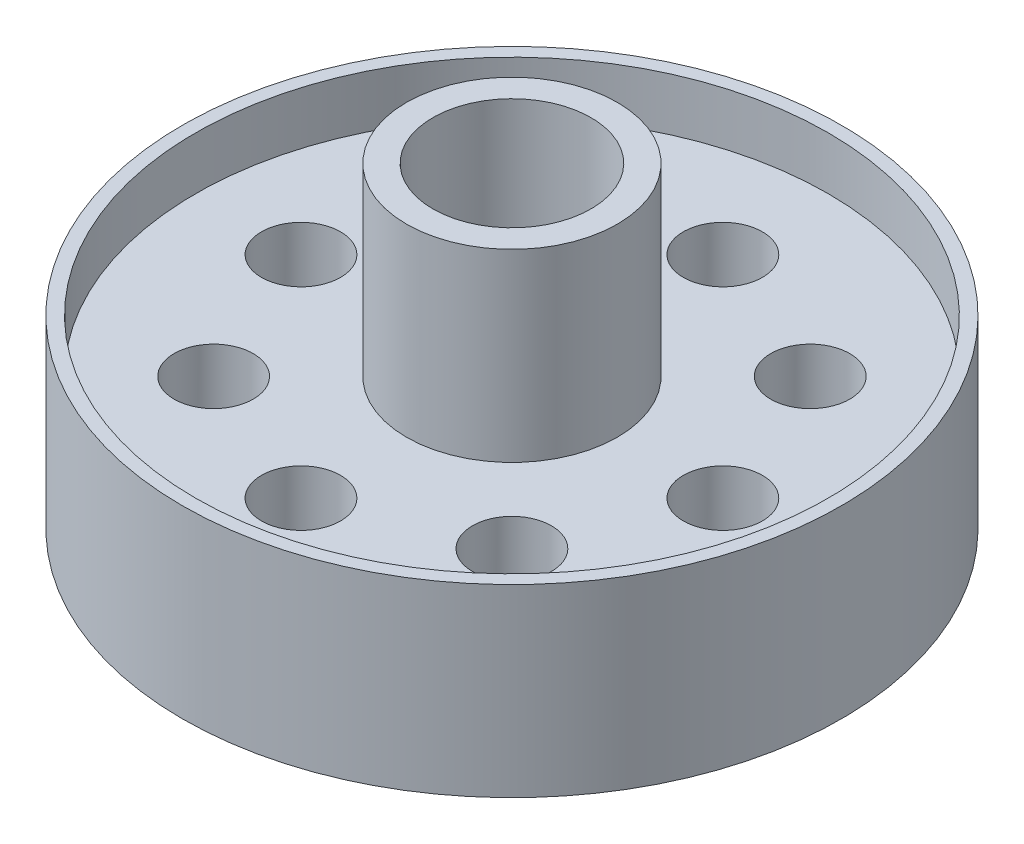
ISO-10303-21;
HEADER;
FILE_DESCRIPTION(('STEP AP214'),'2;1');
FILE_NAME('part.step','',(''),(''),'','','');
FILE_SCHEMA(('AUTOMOTIVE_DESIGN { 1 0 10303 214 1 1 1 1 }'));
ENDSEC;
DATA;
#1=APPLICATION_CONTEXT('core data for automotive mechanical design processes');
#2=APPLICATION_PROTOCOL_DEFINITION('international standard','automotive_design',2000,#1);
#3=PRODUCT_CONTEXT('',#1,'mechanical');
#4=PRODUCT('Part','Part','',(#3));
#5=PRODUCT_RELATED_PRODUCT_CATEGORY('part','',(#4));
#6=PRODUCT_DEFINITION_FORMATION('','',#4);
#7=PRODUCT_DEFINITION_CONTEXT('part definition',#1,'design');
#8=PRODUCT_DEFINITION('design','',#6,#7);
#9=PRODUCT_DEFINITION_SHAPE('','',#8);
#10=(LENGTH_UNIT() NAMED_UNIT(*) SI_UNIT(.MILLI.,.METRE.));
#11=(NAMED_UNIT(*) PLANE_ANGLE_UNIT() SI_UNIT($,.RADIAN.));
#12=(NAMED_UNIT(*) SI_UNIT($,.STERADIAN.) SOLID_ANGLE_UNIT());
#13=UNCERTAINTY_MEASURE_WITH_UNIT(LENGTH_MEASURE(1.E-05),#10,'distance_accuracy_value','');
#14=(GEOMETRIC_REPRESENTATION_CONTEXT(3) GLOBAL_UNCERTAINTY_ASSIGNED_CONTEXT((#13)) GLOBAL_UNIT_ASSIGNED_CONTEXT((#10,
#11,#12)) REPRESENTATION_CONTEXT('',''));
#15=CARTESIAN_POINT('',(0.,0.,0.));
#16=DIRECTION('',(0.,0.,1.));
#17=DIRECTION('',(1.,0.,0.));
#18=AXIS2_PLACEMENT_3D('',#15,#16,#17);
#19=CARTESIAN_POINT('',(0.,2.,0.));
#20=DIRECTION('',(0.,-1.,0.));
#21=DIRECTION('',(0.,0.,-1.));
#22=AXIS2_PLACEMENT_3D('',#19,#20,#21);
#23=PLANE('',#22);
#24=CARTESIAN_POINT('',(5.65685424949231,2.,5.65685424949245));
#25=DIRECTION('',(0.,-1.,0.));
#26=DIRECTION('',(0.,0.,-1.));
#27=AXIS2_PLACEMENT_3D('',#24,#25,#26);
#28=CIRCLE('',#27,1.5);
#29=CARTESIAN_POINT('',(5.65685424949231,2.,4.15685424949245));
#30=VERTEX_POINT('',#29);
#31=EDGE_CURVE('E114',#30,#30,#28,.T.);
#32=ORIENTED_EDGE('',*,*,#31,.F.);
#33=EDGE_LOOP('',(#32));
#34=FACE_BOUND('',#33,.T.);
#35=CARTESIAN_POINT('',(7.99999999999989,2.,-1.14120545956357E-13));
#36=DIRECTION('',(0.,-1.,0.));
#37=DIRECTION('',(0.,0.,-1.));
#38=AXIS2_PLACEMENT_3D('',#35,#36,#37);
#39=CIRCLE('',#38,1.50000000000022);
#40=CARTESIAN_POINT('',(7.99999999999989,2.,-1.50000000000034));
#41=VERTEX_POINT('',#40);
#42=EDGE_CURVE('E108',#41,#41,#39,.T.);
#43=ORIENTED_EDGE('',*,*,#42,.F.);
#44=EDGE_LOOP('',(#43));
#45=FACE_BOUND('',#44,.T.);
#46=CARTESIAN_POINT('',(5.65685424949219,2.,-5.65685424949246));
#47=DIRECTION('',(0.,-1.,0.));
#48=DIRECTION('',(0.,0.,-1.));
#49=AXIS2_PLACEMENT_3D('',#46,#47,#48);
#50=CIRCLE('',#49,1.50000000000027);
#51=CARTESIAN_POINT('',(5.65685424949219,2.,-7.15685424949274));
#52=VERTEX_POINT('',#51);
#53=EDGE_CURVE('E102',#52,#52,#50,.T.);
#54=ORIENTED_EDGE('',*,*,#53,.F.);
#55=EDGE_LOOP('',(#54));
#56=FACE_BOUND('',#55,.T.);
#57=CARTESIAN_POINT('',(-2.26134877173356E-13,2.,-8.));
#58=DIRECTION('',(0.,-1.,0.));
#59=DIRECTION('',(0.,0.,-1.));
#60=AXIS2_PLACEMENT_3D('',#57,#58,#59);
#61=CIRCLE('',#60,1.50000000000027);
#62=CARTESIAN_POINT('',(-2.26134877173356E-13,2.,-9.50000000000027));
#63=VERTEX_POINT('',#62);
#64=EDGE_CURVE('E96',#63,#63,#61,.T.);
#65=ORIENTED_EDGE('',*,*,#64,.F.);
#66=EDGE_LOOP('',(#65));
#67=FACE_BOUND('',#66,.T.);
#68=CARTESIAN_POINT('',(-5.65685424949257,2.,-5.6568542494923));
#69=DIRECTION('',(0.,-1.,0.));
#70=DIRECTION('',(0.,0.,-1.));
#71=AXIS2_PLACEMENT_3D('',#68,#69,#70);
#72=CIRCLE('',#71,1.5000000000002);
#73=CARTESIAN_POINT('',(-5.65685424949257,2.,-7.1568542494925));
#74=VERTEX_POINT('',#73);
#75=EDGE_CURVE('E90',#74,#74,#72,.T.);
#76=ORIENTED_EDGE('',*,*,#75,.F.);
#77=EDGE_LOOP('',(#76));
#78=FACE_BOUND('',#77,.T.);
#79=CARTESIAN_POINT('',(-8.,2.,0.));
#80=DIRECTION('',(0.,-1.,0.));
#81=DIRECTION('',(0.,0.,-1.));
#82=AXIS2_PLACEMENT_3D('',#79,#80,#81);
#83=CIRCLE('',#82,1.5);
#84=CARTESIAN_POINT('',(-8.,2.,-1.50000000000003));
#85=VERTEX_POINT('',#84);
#86=EDGE_CURVE('E84',#85,#85,#83,.T.);
#87=ORIENTED_EDGE('',*,*,#86,.F.);
#88=EDGE_LOOP('',(#87));
#89=FACE_BOUND('',#88,.T.);
#90=CARTESIAN_POINT('',(-5.65685424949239,2.,5.65685424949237));
#91=DIRECTION('',(0.,-1.,0.));
#92=DIRECTION('',(0.,0.,-1.));
#93=AXIS2_PLACEMENT_3D('',#90,#91,#92);
#94=CIRCLE('',#93,1.5);
#95=CARTESIAN_POINT('',(-5.65685424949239,2.,4.15685424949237));
#96=VERTEX_POINT('',#95);
#97=EDGE_CURVE('E78',#96,#96,#94,.T.);
#98=ORIENTED_EDGE('',*,*,#97,.F.);
#99=EDGE_LOOP('',(#98));
#100=FACE_BOUND('',#99,.T.);
#101=CARTESIAN_POINT('',(0.,2.,8.));
#102=DIRECTION('',(0.,-1.,0.));
#103=DIRECTION('',(0.,0.,-1.));
#104=AXIS2_PLACEMENT_3D('',#101,#102,#103);
#105=CIRCLE('',#104,1.5);
#106=CARTESIAN_POINT('',(0.,2.,6.5));
#107=VERTEX_POINT('',#106);
#108=EDGE_CURVE('E72',#107,#107,#105,.T.);
#109=ORIENTED_EDGE('',*,*,#108,.F.);
#110=EDGE_LOOP('',(#109));
#111=FACE_BOUND('',#110,.T.);
#112=CARTESIAN_POINT('',(0.,2.,0.));
#113=DIRECTION('',(0.,-1.,0.));
#114=DIRECTION('',(0.,0.,-1.));
#115=AXIS2_PLACEMENT_3D('',#112,#113,#114);
#116=CIRCLE('',#115,12.);
#117=CARTESIAN_POINT('',(0.,2.,-12.));
#118=VERTEX_POINT('',#117);
#119=EDGE_CURVE('E48',#118,#118,#116,.T.);
#120=ORIENTED_EDGE('',*,*,#119,.T.);
#121=EDGE_LOOP('',(#120));
#122=FACE_BOUND('',#121,.T.);
#123=CARTESIAN_POINT('',(0.,2.,0.));
#124=DIRECTION('',(0.,-1.,0.));
#125=DIRECTION('',(0.,0.,-1.));
#126=AXIS2_PLACEMENT_3D('',#123,#124,#125);
#127=CIRCLE('',#126,4.);
#128=CARTESIAN_POINT('',(0.,2.,-4.));
#129=VERTEX_POINT('',#128);
#130=EDGE_CURVE('E63',#129,#129,#127,.T.);
#131=ORIENTED_EDGE('',*,*,#130,.F.);
#132=EDGE_LOOP('',(#131));
#133=FACE_BOUND('',#132,.T.);
#134=ADVANCED_FACE('F28',(#34,#45,#56,#67,#78,#89,#100,#111,#122,#133),#23,.T.);
#135=CARTESIAN_POINT('',(0.,5.,0.));
#136=DIRECTION('',(0.,1.,0.));
#137=DIRECTION('',(0.,0.,1.));
#138=AXIS2_PLACEMENT_3D('',#135,#136,#137);
#139=PLANE('',#138);
#140=CARTESIAN_POINT('',(5.65685424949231,5.,5.65685424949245));
#141=DIRECTION('',(0.,1.,0.));
#142=DIRECTION('',(0.,0.,1.));
#143=AXIS2_PLACEMENT_3D('',#140,#141,#142);
#144=CIRCLE('',#143,1.5);
#145=CARTESIAN_POINT('',(5.65685424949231,5.,7.15685424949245));
#146=VERTEX_POINT('',#145);
#147=EDGE_CURVE('E117',#146,#146,#144,.T.);
#148=ORIENTED_EDGE('',*,*,#147,.F.);
#149=EDGE_LOOP('',(#148));
#150=FACE_BOUND('',#149,.T.);
#151=CARTESIAN_POINT('',(7.99999999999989,5.,-1.14120545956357E-13));
#152=DIRECTION('',(0.,1.,0.));
#153=DIRECTION('',(0.,0.,1.));
#154=AXIS2_PLACEMENT_3D('',#151,#152,#153);
#155=CIRCLE('',#154,1.50000000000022);
#156=CARTESIAN_POINT('',(7.99999999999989,5.,1.50000000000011));
#157=VERTEX_POINT('',#156);
#158=EDGE_CURVE('E111',#157,#157,#155,.T.);
#159=ORIENTED_EDGE('',*,*,#158,.F.);
#160=EDGE_LOOP('',(#159));
#161=FACE_BOUND('',#160,.T.);
#162=CARTESIAN_POINT('',(5.65685424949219,5.,-5.65685424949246));
#163=DIRECTION('',(0.,1.,0.));
#164=DIRECTION('',(0.,0.,1.));
#165=AXIS2_PLACEMENT_3D('',#162,#163,#164);
#166=CIRCLE('',#165,1.50000000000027);
#167=CARTESIAN_POINT('',(5.65685424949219,5.,-4.15685424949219));
#168=VERTEX_POINT('',#167);
#169=EDGE_CURVE('E105',#168,#168,#166,.T.);
#170=ORIENTED_EDGE('',*,*,#169,.F.);
#171=EDGE_LOOP('',(#170));
#172=FACE_BOUND('',#171,.T.);
#173=CARTESIAN_POINT('',(-2.26134877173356E-13,5.,-8.));
#174=DIRECTION('',(0.,1.,0.));
#175=DIRECTION('',(0.,0.,1.));
#176=AXIS2_PLACEMENT_3D('',#173,#174,#175);
#177=CIRCLE('',#176,1.50000000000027);
#178=CARTESIAN_POINT('',(-2.26134877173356E-13,5.,-6.49999999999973));
#179=VERTEX_POINT('',#178);
#180=EDGE_CURVE('E99',#179,#179,#177,.T.);
#181=ORIENTED_EDGE('',*,*,#180,.F.);
#182=EDGE_LOOP('',(#181));
#183=FACE_BOUND('',#182,.T.);
#184=CARTESIAN_POINT('',(-5.65685424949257,5.,-5.6568542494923));
#185=DIRECTION('',(0.,1.,0.));
#186=DIRECTION('',(0.,0.,1.));
#187=AXIS2_PLACEMENT_3D('',#184,#185,#186);
#188=CIRCLE('',#187,1.5000000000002);
#189=CARTESIAN_POINT('',(-5.65685424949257,5.,-4.1568542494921));
#190=VERTEX_POINT('',#189);
#191=EDGE_CURVE('E93',#190,#190,#188,.T.);
#192=ORIENTED_EDGE('',*,*,#191,.F.);
#193=EDGE_LOOP('',(#192));
#194=FACE_BOUND('',#193,.T.);
#195=CARTESIAN_POINT('',(-8.,5.,0.));
#196=DIRECTION('',(0.,1.,0.));
#197=DIRECTION('',(0.,0.,1.));
#198=AXIS2_PLACEMENT_3D('',#195,#196,#197);
#199=CIRCLE('',#198,1.5);
#200=CARTESIAN_POINT('',(-8.,5.,1.49999999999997));
#201=VERTEX_POINT('',#200);
#202=EDGE_CURVE('E87',#201,#201,#199,.T.);
#203=ORIENTED_EDGE('',*,*,#202,.F.);
#204=EDGE_LOOP('',(#203));
#205=FACE_BOUND('',#204,.T.);
#206=CARTESIAN_POINT('',(-5.65685424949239,5.,5.65685424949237));
#207=DIRECTION('',(0.,1.,0.));
#208=DIRECTION('',(0.,0.,1.));
#209=AXIS2_PLACEMENT_3D('',#206,#207,#208);
#210=CIRCLE('',#209,1.5);
#211=CARTESIAN_POINT('',(-5.65685424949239,5.,7.15685424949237));
#212=VERTEX_POINT('',#211);
#213=EDGE_CURVE('E81',#212,#212,#210,.T.);
#214=ORIENTED_EDGE('',*,*,#213,.F.);
#215=EDGE_LOOP('',(#214));
#216=FACE_BOUND('',#215,.T.);
#217=CARTESIAN_POINT('',(0.,5.,8.));
#218=DIRECTION('',(0.,1.,0.));
#219=DIRECTION('',(0.,0.,1.));
#220=AXIS2_PLACEMENT_3D('',#217,#218,#219);
#221=CIRCLE('',#220,1.5);
#222=CARTESIAN_POINT('',(0.,5.,9.5));
#223=VERTEX_POINT('',#222);
#224=EDGE_CURVE('E75',#223,#223,#221,.T.);
#225=ORIENTED_EDGE('',*,*,#224,.F.);
#226=EDGE_LOOP('',(#225));
#227=FACE_BOUND('',#226,.T.);
#228=CARTESIAN_POINT('',(0.,5.,0.));
#229=DIRECTION('',(0.,1.,0.));
#230=DIRECTION('',(0.,0.,1.));
#231=AXIS2_PLACEMENT_3D('',#228,#229,#230);
#232=CIRCLE('',#231,12.);
#233=CARTESIAN_POINT('',(0.,5.,12.));
#234=VERTEX_POINT('',#233);
#235=EDGE_CURVE('E39',#234,#234,#232,.T.);
#236=ORIENTED_EDGE('',*,*,#235,.T.);
#237=EDGE_LOOP('',(#236));
#238=FACE_BOUND('',#237,.T.);
#239=CARTESIAN_POINT('',(0.,5.,0.));
#240=DIRECTION('',(0.,1.,0.));
#241=DIRECTION('',(0.,0.,1.));
#242=AXIS2_PLACEMENT_3D('',#239,#240,#241);
#243=CIRCLE('',#242,4.);
#244=CARTESIAN_POINT('',(0.,5.,4.));
#245=VERTEX_POINT('',#244);
#246=EDGE_CURVE('E57',#245,#245,#243,.T.);
#247=ORIENTED_EDGE('',*,*,#246,.F.);
#248=EDGE_LOOP('',(#247));
#249=FACE_BOUND('',#248,.T.);
#250=ADVANCED_FACE('F123',(#150,#161,#172,#183,#194,#205,#216,#227,#238,#249),#139,.T.);
#251=CARTESIAN_POINT('',(0.,7.,0.));
#252=DIRECTION('',(0.,-1.,0.));
#253=DIRECTION('',(0.,0.,-1.));
#254=AXIS2_PLACEMENT_3D('',#251,#252,#253);
#255=CYLINDRICAL_SURFACE('',#254,12.5);
#256=CARTESIAN_POINT('',(0.,7.,0.));
#257=DIRECTION('',(0.,1.,0.));
#258=DIRECTION('',(0.,0.,1.));
#259=AXIS2_PLACEMENT_3D('',#256,#257,#258);
#260=CIRCLE('',#259,12.5);
#261=CARTESIAN_POINT('',(0.,7.,12.5));
#262=VERTEX_POINT('',#261);
#263=EDGE_CURVE('E10',#262,#262,#260,.T.);
#264=ORIENTED_EDGE('',*,*,#263,.F.);
#265=EDGE_LOOP('',(#264));
#266=FACE_BOUND('',#265,.T.);
#267=CARTESIAN_POINT('',(0.,0.,0.));
#268=DIRECTION('',(0.,1.,0.));
#269=DIRECTION('',(0.,0.,1.));
#270=AXIS2_PLACEMENT_3D('',#267,#268,#269);
#271=CIRCLE('',#270,12.5);
#272=CARTESIAN_POINT('',(0.,0.,12.5));
#273=VERTEX_POINT('',#272);
#274=EDGE_CURVE('E35',#273,#273,#271,.T.);
#275=ORIENTED_EDGE('',*,*,#274,.T.);
#276=EDGE_LOOP('',(#275));
#277=FACE_BOUND('',#276,.T.);
#278=ADVANCED_FACE('F30',(#266,#277),#255,.T.);
#279=CARTESIAN_POINT('',(0.,7.,0.));
#280=DIRECTION('',(0.,1.,0.));
#281=DIRECTION('',(0.,0.,1.));
#282=AXIS2_PLACEMENT_3D('',#279,#280,#281);
#283=PLANE('',#282);
#284=CARTESIAN_POINT('',(0.,7.,0.));
#285=DIRECTION('',(0.,1.,0.));
#286=DIRECTION('',(0.,0.,1.));
#287=AXIS2_PLACEMENT_3D('',#284,#285,#286);
#288=CIRCLE('',#287,12.);
#289=CARTESIAN_POINT('',(0.,7.,12.));
#290=VERTEX_POINT('',#289);
#291=EDGE_CURVE('E43',#290,#290,#288,.T.);
#292=ORIENTED_EDGE('',*,*,#291,.F.);
#293=EDGE_LOOP('',(#292));
#294=FACE_BOUND('',#293,.T.);
#295=ORIENTED_EDGE('',*,*,#263,.T.);
#296=EDGE_LOOP('',(#295));
#297=FACE_BOUND('',#296,.T.);
#298=ADVANCED_FACE('F175',(#294,#297),#283,.T.);
#299=CARTESIAN_POINT('',(0.,0.,0.));
#300=DIRECTION('',(0.,1.,0.));
#301=DIRECTION('',(0.,0.,1.));
#302=AXIS2_PLACEMENT_3D('',#299,#300,#301);
#303=PLANE('',#302);
#304=CARTESIAN_POINT('',(0.,0.,0.));
#305=DIRECTION('',(0.,-1.,0.));
#306=DIRECTION('',(0.,0.,-1.));
#307=AXIS2_PLACEMENT_3D('',#304,#305,#306);
#308=CIRCLE('',#307,12.);
#309=CARTESIAN_POINT('',(0.,0.,-12.));
#310=VERTEX_POINT('',#309);
#311=EDGE_CURVE('E51',#310,#310,#308,.T.);
#312=ORIENTED_EDGE('',*,*,#311,.F.);
#313=EDGE_LOOP('',(#312));
#314=FACE_BOUND('',#313,.T.);
#315=ORIENTED_EDGE('',*,*,#274,.F.);
#316=EDGE_LOOP('',(#315));
#317=FACE_BOUND('',#316,.T.);
#318=ADVANCED_FACE('F172',(#314,#317),#303,.F.);
#319=CARTESIAN_POINT('',(0.,5.,0.));
#320=DIRECTION('',(0.,1.,0.));
#321=DIRECTION('',(0.,0.,1.));
#322=AXIS2_PLACEMENT_3D('',#319,#320,#321);
#323=CYLINDRICAL_SURFACE('',#322,12.);
#324=ORIENTED_EDGE('',*,*,#235,.F.);
#325=EDGE_LOOP('',(#324));
#326=FACE_BOUND('',#325,.T.);
#327=ORIENTED_EDGE('',*,*,#291,.T.);
#328=EDGE_LOOP('',(#327));
#329=FACE_BOUND('',#328,.T.);
#330=ADVANCED_FACE('F158',(#326,#329),#323,.F.);
#331=CARTESIAN_POINT('',(0.,2.,0.));
#332=DIRECTION('',(0.,-1.,0.));
#333=DIRECTION('',(0.,0.,-1.));
#334=AXIS2_PLACEMENT_3D('',#331,#332,#333);
#335=CYLINDRICAL_SURFACE('',#334,12.);
#336=ORIENTED_EDGE('',*,*,#119,.F.);
#337=EDGE_LOOP('',(#336));
#338=FACE_BOUND('',#337,.T.);
#339=ORIENTED_EDGE('',*,*,#311,.T.);
#340=EDGE_LOOP('',(#339));
#341=FACE_BOUND('',#340,.T.);
#342=ADVANCED_FACE('F148',(#338,#341),#335,.F.);
#343=CARTESIAN_POINT('',(0.,12.,0.));
#344=DIRECTION('',(0.,-1.,0.));
#345=DIRECTION('',(0.,0.,-1.));
#346=AXIS2_PLACEMENT_3D('',#343,#344,#345);
#347=CYLINDRICAL_SURFACE('',#346,4.);
#348=CARTESIAN_POINT('',(0.,12.,0.));
#349=DIRECTION('',(0.,1.,0.));
#350=DIRECTION('',(0.,0.,1.));
#351=AXIS2_PLACEMENT_3D('',#348,#349,#350);
#352=CIRCLE('',#351,4.);
#353=CARTESIAN_POINT('',(0.,12.,4.));
#354=VERTEX_POINT('',#353);
#355=EDGE_CURVE('E54',#354,#354,#352,.T.);
#356=ORIENTED_EDGE('',*,*,#355,.F.);
#357=EDGE_LOOP('',(#356));
#358=FACE_BOUND('',#357,.T.);
#359=ORIENTED_EDGE('',*,*,#246,.T.);
#360=EDGE_LOOP('',(#359));
#361=FACE_BOUND('',#360,.T.);
#362=ADVANCED_FACE('F145',(#358,#361),#347,.T.);
#363=CARTESIAN_POINT('',(0.,12.,0.));
#364=DIRECTION('',(0.,1.,0.));
#365=DIRECTION('',(0.,0.,1.));
#366=AXIS2_PLACEMENT_3D('',#363,#364,#365);
#367=PLANE('',#366);
#368=CARTESIAN_POINT('',(0.,12.,0.));
#369=DIRECTION('',(0.,1.,0.));
#370=DIRECTION('',(0.,0.,1.));
#371=AXIS2_PLACEMENT_3D('',#368,#369,#370);
#372=CIRCLE('',#371,3.);
#373=CARTESIAN_POINT('',(0.,12.,3.));
#374=VERTEX_POINT('',#373);
#375=EDGE_CURVE('E69',#374,#374,#372,.T.);
#376=ORIENTED_EDGE('',*,*,#375,.F.);
#377=EDGE_LOOP('',(#376));
#378=FACE_BOUND('',#377,.T.);
#379=ORIENTED_EDGE('',*,*,#355,.T.);
#380=EDGE_LOOP('',(#379));
#381=FACE_BOUND('',#380,.T.);
#382=ADVANCED_FACE('F147',(#378,#381),#367,.T.);
#383=CARTESIAN_POINT('',(0.,0.,0.));
#384=DIRECTION('',(0.,1.,0.));
#385=DIRECTION('',(0.,0.,1.));
#386=AXIS2_PLACEMENT_3D('',#383,#384,#385);
#387=CYLINDRICAL_SURFACE('',#386,4.);
#388=CARTESIAN_POINT('',(0.,0.,0.));
#389=DIRECTION('',(0.,-1.,0.));
#390=DIRECTION('',(0.,0.,-1.));
#391=AXIS2_PLACEMENT_3D('',#388,#389,#390);
#392=CIRCLE('',#391,4.);
#393=CARTESIAN_POINT('',(0.,0.,-4.));
#394=VERTEX_POINT('',#393);
#395=EDGE_CURVE('E60',#394,#394,#392,.T.);
#396=ORIENTED_EDGE('',*,*,#395,.F.);
#397=EDGE_LOOP('',(#396));
#398=FACE_BOUND('',#397,.T.);
#399=ORIENTED_EDGE('',*,*,#130,.T.);
#400=EDGE_LOOP('',(#399));
#401=FACE_BOUND('',#400,.T.);
#402=ADVANCED_FACE('F155',(#398,#401),#387,.T.);
#403=CARTESIAN_POINT('',(0.,0.,0.));
#404=DIRECTION('',(0.,-1.,0.));
#405=DIRECTION('',(0.,0.,-1.));
#406=AXIS2_PLACEMENT_3D('',#403,#404,#405);
#407=PLANE('',#406);
#408=CARTESIAN_POINT('',(0.,0.,0.));
#409=DIRECTION('',(0.,1.,0.));
#410=DIRECTION('',(0.,0.,1.));
#411=AXIS2_PLACEMENT_3D('',#408,#409,#410);
#412=CIRCLE('',#411,3.);
#413=CARTESIAN_POINT('',(0.,0.,3.));
#414=VERTEX_POINT('',#413);
#415=EDGE_CURVE('E66',#414,#414,#412,.T.);
#416=ORIENTED_EDGE('',*,*,#415,.T.);
#417=EDGE_LOOP('',(#416));
#418=FACE_BOUND('',#417,.T.);
#419=ORIENTED_EDGE('',*,*,#395,.T.);
#420=EDGE_LOOP('',(#419));
#421=FACE_BOUND('',#420,.T.);
#422=ADVANCED_FACE('F284',(#418,#421),#407,.T.);
#423=CARTESIAN_POINT('',(0.,0.,0.));
#424=DIRECTION('',(0.,1.,0.));
#425=DIRECTION('',(0.,0.,1.));
#426=AXIS2_PLACEMENT_3D('',#423,#424,#425);
#427=CYLINDRICAL_SURFACE('',#426,3.);
#428=ORIENTED_EDGE('',*,*,#415,.F.);
#429=EDGE_LOOP('',(#428));
#430=FACE_BOUND('',#429,.T.);
#431=ORIENTED_EDGE('',*,*,#375,.T.);
#432=EDGE_LOOP('',(#431));
#433=FACE_BOUND('',#432,.T.);
#434=ADVANCED_FACE('F207',(#430,#433),#427,.F.);
#435=CARTESIAN_POINT('',(0.,-7.,8.));
#436=DIRECTION('',(0.,1.,0.));
#437=DIRECTION('',(0.,0.,1.));
#438=AXIS2_PLACEMENT_3D('',#435,#436,#437);
#439=CYLINDRICAL_SURFACE('',#438,1.5);
#440=ORIENTED_EDGE('',*,*,#108,.T.);
#441=EDGE_LOOP('',(#440));
#442=FACE_BOUND('',#441,.T.);
#443=ORIENTED_EDGE('',*,*,#224,.T.);
#444=EDGE_LOOP('',(#443));
#445=FACE_BOUND('',#444,.T.);
#446=ADVANCED_FACE('F201',(#442,#445),#439,.F.);
#447=CARTESIAN_POINT('',(-5.65685424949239,-7.,5.65685424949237));
#448=DIRECTION('',(0.,1.,0.));
#449=DIRECTION('',(0.,0.,1.));
#450=AXIS2_PLACEMENT_3D('',#447,#448,#449);
#451=CYLINDRICAL_SURFACE('',#450,1.5);
#452=ORIENTED_EDGE('',*,*,#97,.T.);
#453=EDGE_LOOP('',(#452));
#454=FACE_BOUND('',#453,.T.);
#455=ORIENTED_EDGE('',*,*,#213,.T.);
#456=EDGE_LOOP('',(#455));
#457=FACE_BOUND('',#456,.T.);
#458=ADVANCED_FACE('F206',(#454,#457),#451,.F.);
#459=CARTESIAN_POINT('',(-8.,-7.,0.));
#460=DIRECTION('',(0.,1.,0.));
#461=DIRECTION('',(0.,0.,1.));
#462=AXIS2_PLACEMENT_3D('',#459,#460,#461);
#463=CYLINDRICAL_SURFACE('',#462,1.5);
#464=ORIENTED_EDGE('',*,*,#86,.T.);
#465=EDGE_LOOP('',(#464));
#466=FACE_BOUND('',#465,.T.);
#467=ORIENTED_EDGE('',*,*,#202,.T.);
#468=EDGE_LOOP('',(#467));
#469=FACE_BOUND('',#468,.T.);
#470=ADVANCED_FACE('F219',(#466,#469),#463,.F.);
#471=CARTESIAN_POINT('',(-5.65685424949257,-7.,-5.6568542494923));
#472=DIRECTION('',(0.,1.,0.));
#473=DIRECTION('',(0.,0.,1.));
#474=AXIS2_PLACEMENT_3D('',#471,#472,#473);
#475=CYLINDRICAL_SURFACE('',#474,1.5000000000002);
#476=ORIENTED_EDGE('',*,*,#75,.T.);
#477=EDGE_LOOP('',(#476));
#478=FACE_BOUND('',#477,.T.);
#479=ORIENTED_EDGE('',*,*,#191,.T.);
#480=EDGE_LOOP('',(#479));
#481=FACE_BOUND('',#480,.T.);
#482=ADVANCED_FACE('F229',(#478,#481),#475,.F.);
#483=CARTESIAN_POINT('',(-2.26134877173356E-13,-7.,-8.));
#484=DIRECTION('',(0.,1.,0.));
#485=DIRECTION('',(0.,0.,1.));
#486=AXIS2_PLACEMENT_3D('',#483,#484,#485);
#487=CYLINDRICAL_SURFACE('',#486,1.50000000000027);
#488=ORIENTED_EDGE('',*,*,#64,.T.);
#489=EDGE_LOOP('',(#488));
#490=FACE_BOUND('',#489,.T.);
#491=ORIENTED_EDGE('',*,*,#180,.T.);
#492=EDGE_LOOP('',(#491));
#493=FACE_BOUND('',#492,.T.);
#494=ADVANCED_FACE('F239',(#490,#493),#487,.F.);
#495=CARTESIAN_POINT('',(5.65685424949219,-7.,-5.65685424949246));
#496=DIRECTION('',(0.,1.,0.));
#497=DIRECTION('',(0.,0.,1.));
#498=AXIS2_PLACEMENT_3D('',#495,#496,#497);
#499=CYLINDRICAL_SURFACE('',#498,1.50000000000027);
#500=ORIENTED_EDGE('',*,*,#53,.T.);
#501=EDGE_LOOP('',(#500));
#502=FACE_BOUND('',#501,.T.);
#503=ORIENTED_EDGE('',*,*,#169,.T.);
#504=EDGE_LOOP('',(#503));
#505=FACE_BOUND('',#504,.T.);
#506=ADVANCED_FACE('F249',(#502,#505),#499,.F.);
#507=CARTESIAN_POINT('',(7.99999999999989,-7.,-1.14120545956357E-13));
#508=DIRECTION('',(0.,1.,0.));
#509=DIRECTION('',(0.,0.,1.));
#510=AXIS2_PLACEMENT_3D('',#507,#508,#509);
#511=CYLINDRICAL_SURFACE('',#510,1.50000000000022);
#512=ORIENTED_EDGE('',*,*,#42,.T.);
#513=EDGE_LOOP('',(#512));
#514=FACE_BOUND('',#513,.T.);
#515=ORIENTED_EDGE('',*,*,#158,.T.);
#516=EDGE_LOOP('',(#515));
#517=FACE_BOUND('',#516,.T.);
#518=ADVANCED_FACE('F259',(#514,#517),#511,.F.);
#519=CARTESIAN_POINT('',(5.65685424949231,-7.,5.65685424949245));
#520=DIRECTION('',(0.,1.,0.));
#521=DIRECTION('',(0.,0.,1.));
#522=AXIS2_PLACEMENT_3D('',#519,#520,#521);
#523=CYLINDRICAL_SURFACE('',#522,1.5);
#524=ORIENTED_EDGE('',*,*,#31,.T.);
#525=EDGE_LOOP('',(#524));
#526=FACE_BOUND('',#525,.T.);
#527=ORIENTED_EDGE('',*,*,#147,.T.);
#528=EDGE_LOOP('',(#527));
#529=FACE_BOUND('',#528,.T.);
#530=ADVANCED_FACE('F121',(#526,#529),#523,.F.);
#531=CLOSED_SHELL('',(#134,#250,#278,#298,#318,#330,#342,#362,#382,#402,#422,#434,#446,#458,
#470,#482,#494,#506,#518,#530));
#532=MANIFOLD_SOLID_BREP('B2',#531);
#533=ADVANCED_BREP_SHAPE_REPRESENTATION('',(#18,#532),#14);
#534=SHAPE_DEFINITION_REPRESENTATION(#9,#533);
ENDSEC;
END-ISO-10303-21;
